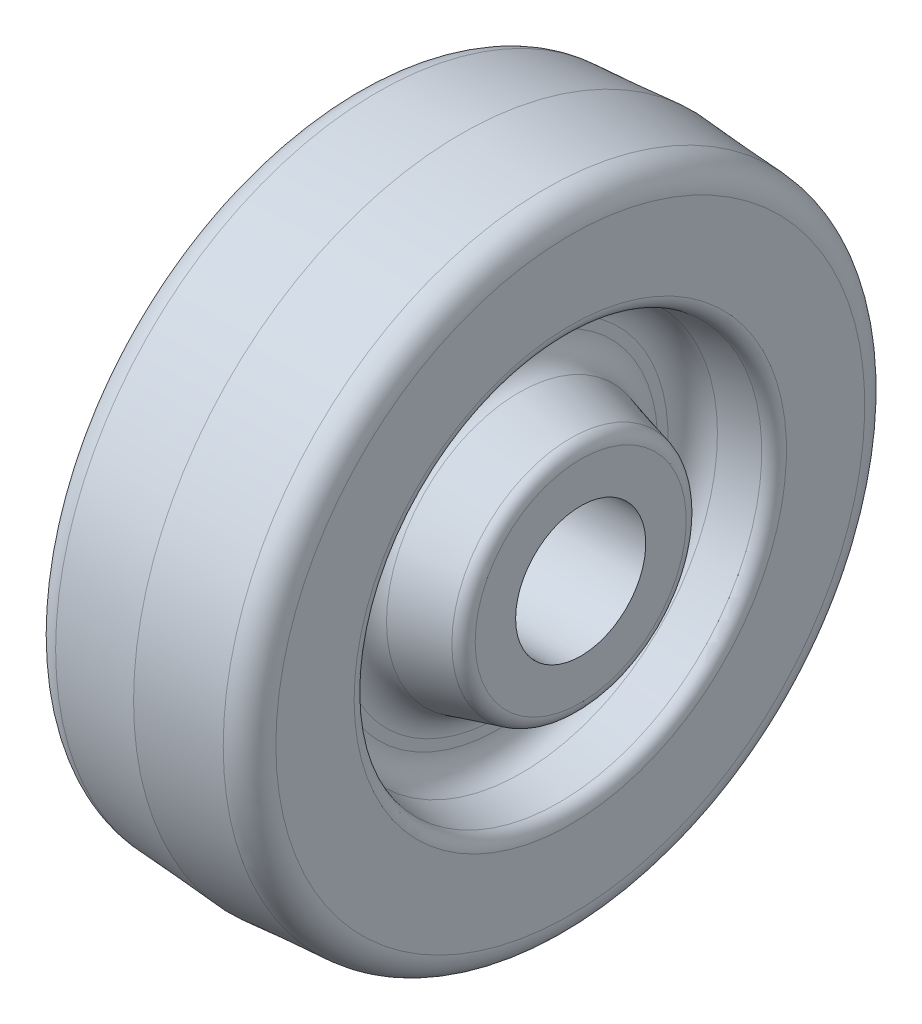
ISO-10303-21;
HEADER;
FILE_DESCRIPTION(('STEP AP214'),'2;1');
FILE_NAME('part.step','',(''),(''),'','','');
FILE_SCHEMA(('AUTOMOTIVE_DESIGN { 1 0 10303 214 1 1 1 1 }'));
ENDSEC;
DATA;
#1=APPLICATION_CONTEXT('core data for automotive mechanical design processes');
#2=APPLICATION_PROTOCOL_DEFINITION('international standard','automotive_design',2000,#1);
#3=PRODUCT_CONTEXT('',#1,'mechanical');
#4=PRODUCT('Part','Part','',(#3));
#5=PRODUCT_RELATED_PRODUCT_CATEGORY('part','',(#4));
#6=PRODUCT_DEFINITION_FORMATION('','',#4);
#7=PRODUCT_DEFINITION_CONTEXT('part definition',#1,'design');
#8=PRODUCT_DEFINITION('design','',#6,#7);
#9=PRODUCT_DEFINITION_SHAPE('','',#8);
#10=(LENGTH_UNIT() NAMED_UNIT(*) SI_UNIT(.MILLI.,.METRE.));
#11=(NAMED_UNIT(*) PLANE_ANGLE_UNIT() SI_UNIT($,.RADIAN.));
#12=(NAMED_UNIT(*) SI_UNIT($,.STERADIAN.) SOLID_ANGLE_UNIT());
#13=UNCERTAINTY_MEASURE_WITH_UNIT(LENGTH_MEASURE(1.E-05),#10,'distance_accuracy_value','');
#14=(GEOMETRIC_REPRESENTATION_CONTEXT(3) GLOBAL_UNCERTAINTY_ASSIGNED_CONTEXT((#13)) GLOBAL_UNIT_ASSIGNED_CONTEXT((#10,
#11,#12)) REPRESENTATION_CONTEXT('',''));
#15=CARTESIAN_POINT('',(0.,0.,0.));
#16=DIRECTION('',(0.,0.,1.));
#17=DIRECTION('',(1.,0.,0.));
#18=AXIS2_PLACEMENT_3D('',#15,#16,#17);
#19=CARTESIAN_POINT('',(0.,0.,0.));
#20=DIRECTION('',(1.,0.,0.));
#21=DIRECTION('',(0.,0.,-1.));
#22=AXIS2_PLACEMENT_3D('',#19,#20,#21);
#23=CONICAL_SURFACE('',#22,76.2,0.0698131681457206);
#24=CARTESIAN_POINT('',(-19.4929535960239,0.,0.));
#25=DIRECTION('',(-1.,0.,0.));
#26=DIRECTION('',(0.,0.,1.));
#27=AXIS2_PLACEMENT_3D('',#24,#25,#26);
#28=CIRCLE('',#27,74.836919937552);
#29=CARTESIAN_POINT('',(-19.4929535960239,0.,74.836919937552));
#30=VERTEX_POINT('',#29);
#31=EDGE_CURVE('E433',#30,#30,#28,.T.);
#32=ORIENTED_EDGE('',*,*,#31,.F.);
#33=EDGE_LOOP('',(#32));
#34=FACE_BOUND('',#33,.T.);
#35=CARTESIAN_POINT('',(0.,0.,0.));
#36=DIRECTION('',(-1.,0.,0.));
#37=DIRECTION('',(0.,0.,1.));
#38=AXIS2_PLACEMENT_3D('',#35,#36,#37);
#39=CIRCLE('',#38,76.2);
#40=CARTESIAN_POINT('',(0.,0.,76.2));
#41=VERTEX_POINT('',#40);
#42=EDGE_CURVE('E10',#41,#41,#39,.T.);
#43=ORIENTED_EDGE('',*,*,#42,.T.);
#44=EDGE_LOOP('',(#43));
#45=FACE_BOUND('',#44,.T.);
#46=ADVANCED_FACE('F360',(#34,#45),#23,.T.);
#47=CARTESIAN_POINT('',(19.4929535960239,0.,0.));
#48=DIRECTION('',(-1.,0.,0.));
#49=DIRECTION('',(0.,0.,1.));
#50=AXIS2_PLACEMENT_3D('',#47,#48,#49);
#51=CONICAL_SURFACE('',#50,74.836919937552,0.0698131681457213);
#52=ORIENTED_EDGE('',*,*,#42,.F.);
#53=EDGE_LOOP('',(#52));
#54=FACE_BOUND('',#53,.T.);
#55=CARTESIAN_POINT('',(19.4929535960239,0.,0.));
#56=DIRECTION('',(-1.,0.,0.));
#57=DIRECTION('',(0.,0.,1.));
#58=AXIS2_PLACEMENT_3D('',#55,#56,#57);
#59=CIRCLE('',#58,74.836919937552);
#60=CARTESIAN_POINT('',(19.4929535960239,0.,74.836919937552));
#61=VERTEX_POINT('',#60);
#62=EDGE_CURVE('E366',#61,#61,#59,.T.);
#63=ORIENTED_EDGE('',*,*,#62,.T.);
#64=EDGE_LOOP('',(#63));
#65=FACE_BOUND('',#64,.T.);
#66=ADVANCED_FACE('F440',(#54,#65),#51,.T.);
#67=CARTESIAN_POINT('',(19.05,0.,0.));
#68=DIRECTION('',(-1.,0.,0.));
#69=DIRECTION('',(0.,0.,1.));
#70=AXIS2_PLACEMENT_3D('',#67,#68,#69);
#71=TOROIDAL_SURFACE('',#70,68.5023882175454,6.34999999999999);
#72=ORIENTED_EDGE('',*,*,#62,.F.);
#73=EDGE_LOOP('',(#72));
#74=FACE_BOUND('',#73,.T.);
#75=CARTESIAN_POINT('',(25.4,0.,0.));
#76=DIRECTION('',(-1.,0.,0.));
#77=DIRECTION('',(0.,0.,1.));
#78=AXIS2_PLACEMENT_3D('',#75,#76,#77);
#79=CIRCLE('',#78,68.5023882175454);
#80=CARTESIAN_POINT('',(25.4,0.,68.5023882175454));
#81=VERTEX_POINT('',#80);
#82=EDGE_CURVE('E370',#81,#81,#79,.T.);
#83=ORIENTED_EDGE('',*,*,#82,.T.);
#84=EDGE_LOOP('',(#83));
#85=FACE_BOUND('',#84,.T.);
#86=ADVANCED_FACE('F444',(#74,#85),#71,.T.);
#87=CARTESIAN_POINT('',(25.4,68.5023882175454,0.));
#88=DIRECTION('',(-1.,0.,0.));
#89=DIRECTION('',(0.,0.,1.));
#90=AXIS2_PLACEMENT_3D('',#87,#88,#89);
#91=PLANE('',#90);
#92=ORIENTED_EDGE('',*,*,#82,.F.);
#93=EDGE_LOOP('',(#92));
#94=FACE_BOUND('',#93,.T.);
#95=CARTESIAN_POINT('',(25.4,0.,0.));
#96=DIRECTION('',(-1.,0.,0.));
#97=DIRECTION('',(0.,0.,1.));
#98=AXIS2_PLACEMENT_3D('',#95,#96,#97);
#99=CIRCLE('',#98,50.2891413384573);
#100=CARTESIAN_POINT('',(25.4,0.,50.2891413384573));
#101=VERTEX_POINT('',#100);
#102=EDGE_CURVE('E374',#101,#101,#99,.T.);
#103=ORIENTED_EDGE('',*,*,#102,.T.);
#104=EDGE_LOOP('',(#103));
#105=FACE_BOUND('',#104,.T.);
#106=ADVANCED_FACE('F449',(#94,#105),#91,.F.);
#107=CARTESIAN_POINT('',(22.225,0.,0.));
#108=DIRECTION('',(-1.,0.,0.));
#109=DIRECTION('',(0.,0.,1.));
#110=AXIS2_PLACEMENT_3D('',#107,#108,#109);
#111=TOROIDAL_SURFACE('',#110,50.2891413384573,3.175);
#112=ORIENTED_EDGE('',*,*,#102,.F.);
#113=EDGE_LOOP('',(#112));
#114=FACE_BOUND('',#113,.T.);
#115=CARTESIAN_POINT('',(22.7763329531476,0.,0.));
#116=DIRECTION('',(-1.,0.,0.));
#117=DIRECTION('',(0.,0.,1.));
#118=AXIS2_PLACEMENT_3D('',#115,#116,#117);
#119=CIRCLE('',#118,47.1623767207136);
#120=CARTESIAN_POINT('',(22.7763329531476,0.,47.1623767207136));
#121=VERTEX_POINT('',#120);
#122=EDGE_CURVE('E379',#121,#121,#119,.T.);
#123=ORIENTED_EDGE('',*,*,#122,.T.);
#124=EDGE_LOOP('',(#123));
#125=FACE_BOUND('',#124,.T.);
#126=ADVANCED_FACE('F455',(#114,#125),#111,.T.);
#127=CARTESIAN_POINT('',(14.0103340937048,0.,0.));
#128=DIRECTION('',(1.,0.,0.));
#129=DIRECTION('',(0.,0.,-1.));
#130=AXIS2_PLACEMENT_3D('',#127,#128,#129);
#131=CONICAL_SURFACE('',#130,45.6166946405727,0.174532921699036);
#132=ORIENTED_EDGE('',*,*,#122,.F.);
#133=EDGE_LOOP('',(#132));
#134=FACE_BOUND('',#133,.T.);
#135=CARTESIAN_POINT('',(14.0103340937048,0.,0.));
#136=DIRECTION('',(-1.,0.,0.));
#137=DIRECTION('',(0.,0.,1.));
#138=AXIS2_PLACEMENT_3D('',#135,#136,#137);
#139=CIRCLE('',#138,45.6166946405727);
#140=CARTESIAN_POINT('',(14.0103340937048,0.,45.6166946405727));
#141=VERTEX_POINT('',#140);
#142=EDGE_CURVE('E382',#141,#141,#139,.T.);
#143=ORIENTED_EDGE('',*,*,#142,.T.);
#144=EDGE_LOOP('',(#143));
#145=FACE_BOUND('',#144,.T.);
#146=ADVANCED_FACE('F459',(#134,#145),#131,.F.);
#147=CARTESIAN_POINT('',(15.113,0.,0.));
#148=DIRECTION('',(-1.,0.,0.));
#149=DIRECTION('',(0.,0.,1.));
#150=AXIS2_PLACEMENT_3D('',#147,#148,#149);
#151=TOROIDAL_SURFACE('',#150,39.3631654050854,6.35);
#152=ORIENTED_EDGE('',*,*,#142,.F.);
#153=EDGE_LOOP('',(#152));
#154=FACE_BOUND('',#153,.T.);
#155=CARTESIAN_POINT('',(8.76299999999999,0.,0.));
#156=DIRECTION('',(-1.,0.,0.));
#157=DIRECTION('',(0.,0.,1.));
#158=AXIS2_PLACEMENT_3D('',#155,#156,#157);
#159=CIRCLE('',#158,39.3631654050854);
#160=CARTESIAN_POINT('',(8.76299999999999,0.,39.3631654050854));
#161=VERTEX_POINT('',#160);
#162=EDGE_CURVE('E385',#161,#161,#159,.T.);
#163=ORIENTED_EDGE('',*,*,#162,.T.);
#164=EDGE_LOOP('',(#163));
#165=FACE_BOUND('',#164,.T.);
#166=ADVANCED_FACE('F463',(#154,#165),#151,.F.);
#167=CARTESIAN_POINT('',(8.763,39.3631654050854,0.));
#168=DIRECTION('',(-1.,0.,0.));
#169=DIRECTION('',(0.,0.,1.));
#170=AXIS2_PLACEMENT_3D('',#167,#168,#169);
#171=PLANE('',#170);
#172=ORIENTED_EDGE('',*,*,#162,.F.);
#173=EDGE_LOOP('',(#172));
#174=FACE_BOUND('',#173,.T.);
#175=CARTESIAN_POINT('',(8.763,0.,0.));
#176=DIRECTION('',(-1.,0.,0.));
#177=DIRECTION('',(0.,0.,1.));
#178=AXIS2_PLACEMENT_3D('',#175,#176,#177);
#179=CIRCLE('',#178,36.9644584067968);
#180=CARTESIAN_POINT('',(8.763,0.,36.9644584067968));
#181=VERTEX_POINT('',#180);
#182=EDGE_CURVE('E388',#181,#181,#179,.T.);
#183=ORIENTED_EDGE('',*,*,#182,.T.);
#184=EDGE_LOOP('',(#183));
#185=FACE_BOUND('',#184,.T.);
#186=ADVANCED_FACE('F467',(#174,#185),#171,.F.);
#187=CARTESIAN_POINT('',(15.113,0.,0.));
#188=DIRECTION('',(-1.,0.,0.));
#189=DIRECTION('',(0.,0.,1.));
#190=AXIS2_PLACEMENT_3D('',#187,#188,#189);
#191=TOROIDAL_SURFACE('',#190,36.9644584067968,6.35);
#192=ORIENTED_EDGE('',*,*,#182,.F.);
#193=EDGE_LOOP('',(#192));
#194=FACE_BOUND('',#193,.T.);
#195=CARTESIAN_POINT('',(13.4694990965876,0.,0.));
#196=DIRECTION('',(-1.,0.,0.));
#197=DIRECTION('',(0.,0.,1.));
#198=AXIS2_PLACEMENT_3D('',#195,#196,#197);
#199=CIRCLE('',#198,30.830829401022);
#200=CARTESIAN_POINT('',(13.4694990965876,0.,30.830829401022));
#201=VERTEX_POINT('',#200);
#202=EDGE_CURVE('E391',#201,#201,#199,.T.);
#203=ORIENTED_EDGE('',*,*,#202,.T.);
#204=EDGE_LOOP('',(#203));
#205=FACE_BOUND('',#204,.T.);
#206=ADVANCED_FACE('F471',(#194,#205),#191,.F.);
#207=CARTESIAN_POINT('',(25.4597504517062,0.,0.));
#208=DIRECTION('',(-1.,0.,0.));
#209=DIRECTION('',(0.,0.,1.));
#210=AXIS2_PLACEMENT_3D('',#207,#208,#209);
#211=CONICAL_SURFACE('',#210,27.618051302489,0.261799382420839);
#212=ORIENTED_EDGE('',*,*,#202,.F.);
#213=EDGE_LOOP('',(#212));
#214=FACE_BOUND('',#213,.T.);
#215=CARTESIAN_POINT('',(25.4597504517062,0.,0.));
#216=DIRECTION('',(-1.,0.,0.));
#217=DIRECTION('',(0.,0.,1.));
#218=AXIS2_PLACEMENT_3D('',#215,#216,#217);
#219=CIRCLE('',#218,27.618051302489);
#220=CARTESIAN_POINT('',(25.4597504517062,0.,27.618051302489));
#221=VERTEX_POINT('',#220);
#222=EDGE_CURVE('E394',#221,#221,#219,.T.);
#223=ORIENTED_EDGE('',*,*,#222,.T.);
#224=EDGE_LOOP('',(#223));
#225=FACE_BOUND('',#224,.T.);
#226=ADVANCED_FACE('F475',(#214,#225),#211,.T.);
#227=CARTESIAN_POINT('',(24.638,0.,0.));
#228=DIRECTION('',(-1.,0.,0.));
#229=DIRECTION('',(0.,0.,1.));
#230=AXIS2_PLACEMENT_3D('',#227,#228,#229);
#231=TOROIDAL_SURFACE('',#230,24.5512367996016,3.175);
#232=ORIENTED_EDGE('',*,*,#222,.F.);
#233=EDGE_LOOP('',(#232));
#234=FACE_BOUND('',#233,.T.);
#235=CARTESIAN_POINT('',(27.813,0.,0.));
#236=DIRECTION('',(-1.,0.,0.));
#237=DIRECTION('',(0.,0.,1.));
#238=AXIS2_PLACEMENT_3D('',#235,#236,#237);
#239=CIRCLE('',#238,24.5512367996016);
#240=CARTESIAN_POINT('',(27.813,0.,24.5512367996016));
#241=VERTEX_POINT('',#240);
#242=EDGE_CURVE('E397',#241,#241,#239,.T.);
#243=ORIENTED_EDGE('',*,*,#242,.T.);
#244=EDGE_LOOP('',(#243));
#245=FACE_BOUND('',#244,.T.);
#246=ADVANCED_FACE('F479',(#234,#245),#231,.T.);
#247=CARTESIAN_POINT('',(27.813,24.5512367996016,0.));
#248=DIRECTION('',(-1.,0.,0.));
#249=DIRECTION('',(0.,0.,1.));
#250=AXIS2_PLACEMENT_3D('',#247,#248,#249);
#251=PLANE('',#250);
#252=ORIENTED_EDGE('',*,*,#242,.F.);
#253=EDGE_LOOP('',(#252));
#254=FACE_BOUND('',#253,.T.);
#255=CARTESIAN_POINT('',(27.813,0.,0.));
#256=DIRECTION('',(-1.,0.,0.));
#257=DIRECTION('',(0.,0.,1.));
#258=AXIS2_PLACEMENT_3D('',#255,#256,#257);
#259=CIRCLE('',#258,15.1384);
#260=CARTESIAN_POINT('',(27.813,0.,15.1384));
#261=VERTEX_POINT('',#260);
#262=EDGE_CURVE('E400',#261,#261,#259,.T.);
#263=ORIENTED_EDGE('',*,*,#262,.T.);
#264=EDGE_LOOP('',(#263));
#265=FACE_BOUND('',#264,.T.);
#266=ADVANCED_FACE('F483',(#254,#265),#251,.F.);
#267=CARTESIAN_POINT('',(-38.862204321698,0.,0.));
#268=DIRECTION('',(-1.,0.,0.));
#269=DIRECTION('',(0.,0.,1.));
#270=AXIS2_PLACEMENT_3D('',#267,#268,#269);
#271=CYLINDRICAL_SURFACE('',#270,15.1384);
#272=ORIENTED_EDGE('',*,*,#262,.F.);
#273=EDGE_LOOP('',(#272));
#274=FACE_BOUND('',#273,.T.);
#275=CARTESIAN_POINT('',(-27.813,0.,0.));
#276=DIRECTION('',(-1.,0.,0.));
#277=DIRECTION('',(0.,0.,1.));
#278=AXIS2_PLACEMENT_3D('',#275,#276,#277);
#279=CIRCLE('',#278,15.1384);
#280=CARTESIAN_POINT('',(-27.813,0.,15.1384));
#281=VERTEX_POINT('',#280);
#282=EDGE_CURVE('E403',#281,#281,#279,.T.);
#283=ORIENTED_EDGE('',*,*,#282,.T.);
#284=EDGE_LOOP('',(#283));
#285=FACE_BOUND('',#284,.T.);
#286=ADVANCED_FACE('F487',(#274,#285),#271,.F.);
#287=CARTESIAN_POINT('',(-27.813,15.1384,0.));
#288=DIRECTION('',(1.,0.,0.));
#289=DIRECTION('',(0.,0.,-1.));
#290=AXIS2_PLACEMENT_3D('',#287,#288,#289);
#291=PLANE('',#290);
#292=ORIENTED_EDGE('',*,*,#282,.F.);
#293=EDGE_LOOP('',(#292));
#294=FACE_BOUND('',#293,.T.);
#295=CARTESIAN_POINT('',(-27.813,0.,0.));
#296=DIRECTION('',(-1.,0.,0.));
#297=DIRECTION('',(0.,0.,1.));
#298=AXIS2_PLACEMENT_3D('',#295,#296,#297);
#299=CIRCLE('',#298,24.5512367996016);
#300=CARTESIAN_POINT('',(-27.813,0.,24.5512367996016));
#301=VERTEX_POINT('',#300);
#302=EDGE_CURVE('E406',#301,#301,#299,.T.);
#303=ORIENTED_EDGE('',*,*,#302,.T.);
#304=EDGE_LOOP('',(#303));
#305=FACE_BOUND('',#304,.T.);
#306=ADVANCED_FACE('F491',(#294,#305),#291,.F.);
#307=CARTESIAN_POINT('',(-24.638,0.,0.));
#308=DIRECTION('',(-1.,0.,0.));
#309=DIRECTION('',(0.,0.,1.));
#310=AXIS2_PLACEMENT_3D('',#307,#308,#309);
#311=TOROIDAL_SURFACE('',#310,24.5512367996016,3.175);
#312=ORIENTED_EDGE('',*,*,#302,.F.);
#313=EDGE_LOOP('',(#312));
#314=FACE_BOUND('',#313,.T.);
#315=CARTESIAN_POINT('',(-25.4597504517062,0.,0.));
#316=DIRECTION('',(-1.,0.,0.));
#317=DIRECTION('',(0.,0.,1.));
#318=AXIS2_PLACEMENT_3D('',#315,#316,#317);
#319=CIRCLE('',#318,27.618051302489);
#320=CARTESIAN_POINT('',(-25.4597504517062,0.,27.618051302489));
#321=VERTEX_POINT('',#320);
#322=EDGE_CURVE('E409',#321,#321,#319,.T.);
#323=ORIENTED_EDGE('',*,*,#322,.T.);
#324=EDGE_LOOP('',(#323));
#325=FACE_BOUND('',#324,.T.);
#326=ADVANCED_FACE('F495',(#314,#325),#311,.T.);
#327=CARTESIAN_POINT('',(-13.4694990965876,0.,0.));
#328=DIRECTION('',(1.,0.,0.));
#329=DIRECTION('',(0.,0.,-1.));
#330=AXIS2_PLACEMENT_3D('',#327,#328,#329);
#331=CONICAL_SURFACE('',#330,30.830829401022,0.261799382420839);
#332=ORIENTED_EDGE('',*,*,#322,.F.);
#333=EDGE_LOOP('',(#332));
#334=FACE_BOUND('',#333,.T.);
#335=CARTESIAN_POINT('',(-13.4694990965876,0.,0.));
#336=DIRECTION('',(-1.,0.,0.));
#337=DIRECTION('',(0.,0.,1.));
#338=AXIS2_PLACEMENT_3D('',#335,#336,#337);
#339=CIRCLE('',#338,30.830829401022);
#340=CARTESIAN_POINT('',(-13.4694990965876,0.,30.830829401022));
#341=VERTEX_POINT('',#340);
#342=EDGE_CURVE('E412',#341,#341,#339,.T.);
#343=ORIENTED_EDGE('',*,*,#342,.T.);
#344=EDGE_LOOP('',(#343));
#345=FACE_BOUND('',#344,.T.);
#346=ADVANCED_FACE('F499',(#334,#345),#331,.T.);
#347=CARTESIAN_POINT('',(-15.113,0.,0.));
#348=DIRECTION('',(-1.,0.,0.));
#349=DIRECTION('',(0.,0.,1.));
#350=AXIS2_PLACEMENT_3D('',#347,#348,#349);
#351=TOROIDAL_SURFACE('',#350,36.9644584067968,6.35);
#352=ORIENTED_EDGE('',*,*,#342,.F.);
#353=EDGE_LOOP('',(#352));
#354=FACE_BOUND('',#353,.T.);
#355=CARTESIAN_POINT('',(-8.763,0.,0.));
#356=DIRECTION('',(-1.,0.,0.));
#357=DIRECTION('',(0.,0.,1.));
#358=AXIS2_PLACEMENT_3D('',#355,#356,#357);
#359=CIRCLE('',#358,36.9644584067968);
#360=CARTESIAN_POINT('',(-8.763,0.,36.9644584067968));
#361=VERTEX_POINT('',#360);
#362=EDGE_CURVE('E415',#361,#361,#359,.T.);
#363=ORIENTED_EDGE('',*,*,#362,.T.);
#364=EDGE_LOOP('',(#363));
#365=FACE_BOUND('',#364,.T.);
#366=ADVANCED_FACE('F503',(#354,#365),#351,.F.);
#367=CARTESIAN_POINT('',(-8.763,36.9644584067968,0.));
#368=DIRECTION('',(1.,0.,0.));
#369=DIRECTION('',(0.,0.,-1.));
#370=AXIS2_PLACEMENT_3D('',#367,#368,#369);
#371=PLANE('',#370);
#372=ORIENTED_EDGE('',*,*,#362,.F.);
#373=EDGE_LOOP('',(#372));
#374=FACE_BOUND('',#373,.T.);
#375=CARTESIAN_POINT('',(-8.763,0.,0.));
#376=DIRECTION('',(-1.,0.,0.));
#377=DIRECTION('',(0.,0.,1.));
#378=AXIS2_PLACEMENT_3D('',#375,#376,#377);
#379=CIRCLE('',#378,39.3631654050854);
#380=CARTESIAN_POINT('',(-8.763,0.,39.3631654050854));
#381=VERTEX_POINT('',#380);
#382=EDGE_CURVE('E418',#381,#381,#379,.T.);
#383=ORIENTED_EDGE('',*,*,#382,.T.);
#384=EDGE_LOOP('',(#383));
#385=FACE_BOUND('',#384,.T.);
#386=ADVANCED_FACE('F507',(#374,#385),#371,.F.);
#387=CARTESIAN_POINT('',(-15.113,0.,0.));
#388=DIRECTION('',(-1.,0.,0.));
#389=DIRECTION('',(0.,0.,1.));
#390=AXIS2_PLACEMENT_3D('',#387,#388,#389);
#391=TOROIDAL_SURFACE('',#390,39.3631654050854,6.35);
#392=ORIENTED_EDGE('',*,*,#382,.F.);
#393=EDGE_LOOP('',(#392));
#394=FACE_BOUND('',#393,.T.);
#395=CARTESIAN_POINT('',(-14.0103340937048,0.,0.));
#396=DIRECTION('',(-1.,0.,0.));
#397=DIRECTION('',(0.,0.,1.));
#398=AXIS2_PLACEMENT_3D('',#395,#396,#397);
#399=CIRCLE('',#398,45.6166946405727);
#400=CARTESIAN_POINT('',(-14.0103340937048,0.,45.6166946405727));
#401=VERTEX_POINT('',#400);
#402=EDGE_CURVE('E421',#401,#401,#399,.T.);
#403=ORIENTED_EDGE('',*,*,#402,.T.);
#404=EDGE_LOOP('',(#403));
#405=FACE_BOUND('',#404,.T.);
#406=ADVANCED_FACE('F511',(#394,#405),#391,.F.);
#407=CARTESIAN_POINT('',(-22.7763329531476,0.,0.));
#408=DIRECTION('',(-1.,0.,0.));
#409=DIRECTION('',(0.,0.,1.));
#410=AXIS2_PLACEMENT_3D('',#407,#408,#409);
#411=CONICAL_SURFACE('',#410,47.1623767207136,0.174532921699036);
#412=ORIENTED_EDGE('',*,*,#402,.F.);
#413=EDGE_LOOP('',(#412));
#414=FACE_BOUND('',#413,.T.);
#415=CARTESIAN_POINT('',(-22.7763329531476,0.,0.));
#416=DIRECTION('',(-1.,0.,0.));
#417=DIRECTION('',(0.,0.,1.));
#418=AXIS2_PLACEMENT_3D('',#415,#416,#417);
#419=CIRCLE('',#418,47.1623767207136);
#420=CARTESIAN_POINT('',(-22.7763329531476,0.,47.1623767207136));
#421=VERTEX_POINT('',#420);
#422=EDGE_CURVE('E424',#421,#421,#419,.T.);
#423=ORIENTED_EDGE('',*,*,#422,.T.);
#424=EDGE_LOOP('',(#423));
#425=FACE_BOUND('',#424,.T.);
#426=ADVANCED_FACE('F515',(#414,#425),#411,.F.);
#427=CARTESIAN_POINT('',(-22.225,0.,0.));
#428=DIRECTION('',(-1.,0.,0.));
#429=DIRECTION('',(0.,0.,1.));
#430=AXIS2_PLACEMENT_3D('',#427,#428,#429);
#431=TOROIDAL_SURFACE('',#430,50.2891413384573,3.175);
#432=ORIENTED_EDGE('',*,*,#422,.F.);
#433=EDGE_LOOP('',(#432));
#434=FACE_BOUND('',#433,.T.);
#435=CARTESIAN_POINT('',(-25.4,0.,0.));
#436=DIRECTION('',(-1.,0.,0.));
#437=DIRECTION('',(0.,0.,1.));
#438=AXIS2_PLACEMENT_3D('',#435,#436,#437);
#439=CIRCLE('',#438,50.2891413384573);
#440=CARTESIAN_POINT('',(-25.4,0.,50.2891413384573));
#441=VERTEX_POINT('',#440);
#442=EDGE_CURVE('E427',#441,#441,#439,.T.);
#443=ORIENTED_EDGE('',*,*,#442,.T.);
#444=EDGE_LOOP('',(#443));
#445=FACE_BOUND('',#444,.T.);
#446=ADVANCED_FACE('F519',(#434,#445),#431,.T.);
#447=CARTESIAN_POINT('',(-25.4,50.2891413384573,0.));
#448=DIRECTION('',(1.,0.,0.));
#449=DIRECTION('',(0.,0.,-1.));
#450=AXIS2_PLACEMENT_3D('',#447,#448,#449);
#451=PLANE('',#450);
#452=ORIENTED_EDGE('',*,*,#442,.F.);
#453=EDGE_LOOP('',(#452));
#454=FACE_BOUND('',#453,.T.);
#455=CARTESIAN_POINT('',(-25.4,0.,0.));
#456=DIRECTION('',(-1.,0.,0.));
#457=DIRECTION('',(0.,0.,1.));
#458=AXIS2_PLACEMENT_3D('',#455,#456,#457);
#459=CIRCLE('',#458,68.5023882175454);
#460=CARTESIAN_POINT('',(-25.4,0.,68.5023882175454));
#461=VERTEX_POINT('',#460);
#462=EDGE_CURVE('E430',#461,#461,#459,.T.);
#463=ORIENTED_EDGE('',*,*,#462,.T.);
#464=EDGE_LOOP('',(#463));
#465=FACE_BOUND('',#464,.T.);
#466=ADVANCED_FACE('F523',(#454,#465),#451,.F.);
#467=CARTESIAN_POINT('',(-19.05,0.,0.));
#468=DIRECTION('',(-1.,0.,0.));
#469=DIRECTION('',(0.,0.,1.));
#470=AXIS2_PLACEMENT_3D('',#467,#468,#469);
#471=TOROIDAL_SURFACE('',#470,68.5023882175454,6.34999999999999);
#472=ORIENTED_EDGE('',*,*,#462,.F.);
#473=EDGE_LOOP('',(#472));
#474=FACE_BOUND('',#473,.T.);
#475=ORIENTED_EDGE('',*,*,#31,.T.);
#476=EDGE_LOOP('',(#475));
#477=FACE_BOUND('',#476,.T.);
#478=ADVANCED_FACE('F437',(#474,#477),#471,.T.);
#479=CLOSED_SHELL('',(#46,#66,#86,#106,#126,#146,#166,#186,#206,#226,#246,#266,#286,#306,#326,
#346,#366,#386,#406,#426,#446,#466,#478));
#480=MANIFOLD_SOLID_BREP('B2',#479);
#481=ADVANCED_BREP_SHAPE_REPRESENTATION('',(#18,#480),#14);
#482=SHAPE_DEFINITION_REPRESENTATION(#9,#481);
ENDSEC;
END-ISO-10303-21;
